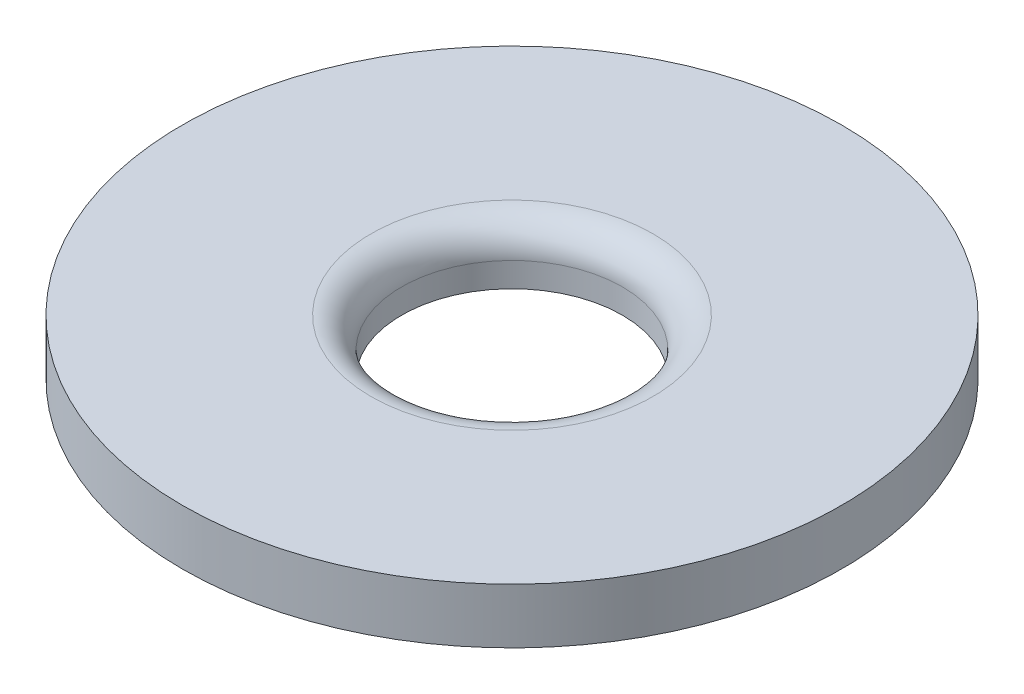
ISO-10303-21;
HEADER;
FILE_DESCRIPTION(('STEP AP214'),'2;1');
FILE_NAME('part.step','',(''),(''),'','','');
FILE_SCHEMA(('AUTOMOTIVE_DESIGN { 1 0 10303 214 1 1 1 1 }'));
ENDSEC;
DATA;
#1=APPLICATION_CONTEXT('core data for automotive mechanical design processes');
#2=APPLICATION_PROTOCOL_DEFINITION('international standard','automotive_design',2000,#1);
#3=PRODUCT_CONTEXT('',#1,'mechanical');
#4=PRODUCT('Part','Part','',(#3));
#5=PRODUCT_RELATED_PRODUCT_CATEGORY('part','',(#4));
#6=PRODUCT_DEFINITION_FORMATION('','',#4);
#7=PRODUCT_DEFINITION_CONTEXT('part definition',#1,'design');
#8=PRODUCT_DEFINITION('design','',#6,#7);
#9=PRODUCT_DEFINITION_SHAPE('','',#8);
#10=(LENGTH_UNIT() NAMED_UNIT(*) SI_UNIT(.MILLI.,.METRE.));
#11=(NAMED_UNIT(*) PLANE_ANGLE_UNIT() SI_UNIT($,.RADIAN.));
#12=(NAMED_UNIT(*) SI_UNIT($,.STERADIAN.) SOLID_ANGLE_UNIT());
#13=UNCERTAINTY_MEASURE_WITH_UNIT(LENGTH_MEASURE(1.E-05),#10,'distance_accuracy_value','');
#14=(GEOMETRIC_REPRESENTATION_CONTEXT(3) GLOBAL_UNCERTAINTY_ASSIGNED_CONTEXT((#13)) GLOBAL_UNIT_ASSIGNED_CONTEXT((#10,
#11,#12)) REPRESENTATION_CONTEXT('',''));
#15=CARTESIAN_POINT('',(0.,0.,0.));
#16=DIRECTION('',(0.,0.,1.));
#17=DIRECTION('',(1.,0.,0.));
#18=AXIS2_PLACEMENT_3D('',#15,#16,#17);
#19=CARTESIAN_POINT('',(0.,0.,0.));
#20=DIRECTION('',(0.,-1.,0.));
#21=DIRECTION('',(0.,0.,-1.));
#22=AXIS2_PLACEMENT_3D('',#19,#20,#21);
#23=CYLINDRICAL_SURFACE('',#22,3.6);
#24=CARTESIAN_POINT('',(0.,-0.3,0.));
#25=DIRECTION('',(0.,-1.,0.));
#26=DIRECTION('',(0.,0.,-1.));
#27=AXIS2_PLACEMENT_3D('',#24,#25,#26);
#28=CIRCLE('',#27,3.6);
#29=CARTESIAN_POINT('',(0.,-0.3,-3.6));
#30=VERTEX_POINT('',#29);
#31=EDGE_CURVE('E48',#30,#30,#28,.T.);
#32=ORIENTED_EDGE('',*,*,#31,.T.);
#33=EDGE_LOOP('',(#32));
#34=FACE_BOUND('',#33,.T.);
#35=CARTESIAN_POINT('',(0.,0.499999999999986,0.));
#36=DIRECTION('',(0.,-1.,0.));
#37=DIRECTION('',(0.,0.,-1.));
#38=AXIS2_PLACEMENT_3D('',#35,#36,#37);
#39=CIRCLE('',#38,3.6);
#40=CARTESIAN_POINT('',(0.,0.499999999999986,-3.6));
#41=VERTEX_POINT('',#40);
#42=EDGE_CURVE('E10',#41,#41,#39,.T.);
#43=ORIENTED_EDGE('',*,*,#42,.F.);
#44=EDGE_LOOP('',(#43));
#45=FACE_BOUND('',#44,.T.);
#46=ADVANCED_FACE('F29',(#34,#45),#23,.F.);
#47=CARTESIAN_POINT('',(0.,0.5,0.));
#48=DIRECTION('',(0.,-1.,0.));
#49=DIRECTION('',(0.,0.,-1.));
#50=AXIS2_PLACEMENT_3D('',#47,#48,#49);
#51=TOROIDAL_SURFACE('',#50,4.6,1.);
#52=ORIENTED_EDGE('',*,*,#42,.T.);
#53=EDGE_LOOP('',(#52));
#54=FACE_BOUND('',#53,.T.);
#55=CARTESIAN_POINT('',(0.,1.5,0.));
#56=DIRECTION('',(0.,-1.,0.));
#57=DIRECTION('',(0.,0.,-1.));
#58=AXIS2_PLACEMENT_3D('',#55,#56,#57);
#59=CIRCLE('',#58,4.6);
#60=CARTESIAN_POINT('',(0.,1.5,-4.6));
#61=VERTEX_POINT('',#60);
#62=EDGE_CURVE('E35',#61,#61,#59,.T.);
#63=ORIENTED_EDGE('',*,*,#62,.F.);
#64=EDGE_LOOP('',(#63));
#65=FACE_BOUND('',#64,.T.);
#66=ADVANCED_FACE('F66',(#54,#65),#51,.T.);
#67=CARTESIAN_POINT('',(4.6,1.5,0.));
#68=DIRECTION('',(0.,1.,0.));
#69=DIRECTION('',(0.,0.,1.));
#70=AXIS2_PLACEMENT_3D('',#67,#68,#69);
#71=PLANE('',#70);
#72=ORIENTED_EDGE('',*,*,#62,.T.);
#73=EDGE_LOOP('',(#72));
#74=FACE_BOUND('',#73,.T.);
#75=CARTESIAN_POINT('',(0.,1.5,0.));
#76=DIRECTION('',(0.,-1.,0.));
#77=DIRECTION('',(0.,0.,-1.));
#78=AXIS2_PLACEMENT_3D('',#75,#76,#77);
#79=CIRCLE('',#78,10.75);
#80=CARTESIAN_POINT('',(0.,1.5,-10.75));
#81=VERTEX_POINT('',#80);
#82=EDGE_CURVE('E39',#81,#81,#79,.T.);
#83=ORIENTED_EDGE('',*,*,#82,.F.);
#84=EDGE_LOOP('',(#83));
#85=FACE_BOUND('',#84,.T.);
#86=ADVANCED_FACE('F62',(#74,#85),#71,.T.);
#87=CARTESIAN_POINT('',(0.,0.,0.));
#88=DIRECTION('',(0.,-1.,0.));
#89=DIRECTION('',(0.,0.,-1.));
#90=AXIS2_PLACEMENT_3D('',#87,#88,#89);
#91=CYLINDRICAL_SURFACE('',#90,10.75);
#92=ORIENTED_EDGE('',*,*,#82,.T.);
#93=EDGE_LOOP('',(#92));
#94=FACE_BOUND('',#93,.T.);
#95=CARTESIAN_POINT('',(0.,-0.3,0.));
#96=DIRECTION('',(0.,-1.,0.));
#97=DIRECTION('',(0.,0.,-1.));
#98=AXIS2_PLACEMENT_3D('',#95,#96,#97);
#99=CIRCLE('',#98,10.75);
#100=CARTESIAN_POINT('',(0.,-0.3,-10.75));
#101=VERTEX_POINT('',#100);
#102=EDGE_CURVE('E43',#101,#101,#99,.T.);
#103=ORIENTED_EDGE('',*,*,#102,.F.);
#104=EDGE_LOOP('',(#103));
#105=FACE_BOUND('',#104,.T.);
#106=ADVANCED_FACE('F56',(#94,#105),#91,.T.);
#107=CARTESIAN_POINT('',(3.6,-0.3,0.));
#108=DIRECTION('',(0.,-1.,0.));
#109=DIRECTION('',(0.,0.,-1.));
#110=AXIS2_PLACEMENT_3D('',#107,#108,#109);
#111=PLANE('',#110);
#112=ORIENTED_EDGE('',*,*,#102,.T.);
#113=EDGE_LOOP('',(#112));
#114=FACE_BOUND('',#113,.T.);
#115=ORIENTED_EDGE('',*,*,#31,.F.);
#116=EDGE_LOOP('',(#115));
#117=FACE_BOUND('',#116,.T.);
#118=ADVANCED_FACE('F54',(#114,#117),#111,.T.);
#119=CLOSED_SHELL('',(#46,#66,#86,#106,#118));
#120=MANIFOLD_SOLID_BREP('B2',#119);
#121=ADVANCED_BREP_SHAPE_REPRESENTATION('',(#18,#120),#14);
#122=SHAPE_DEFINITION_REPRESENTATION(#9,#121);
ENDSEC;
END-ISO-10303-21;
